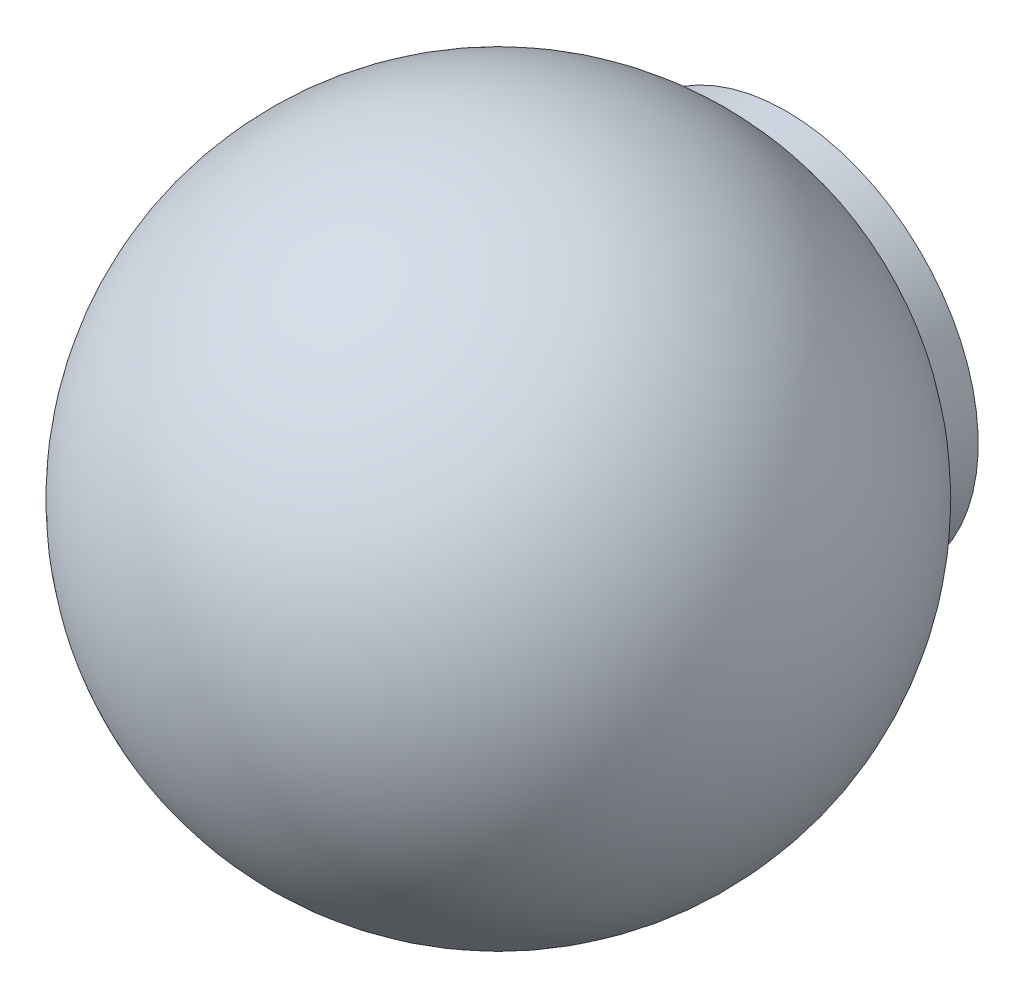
ISO-10303-21;
HEADER;
FILE_DESCRIPTION(('STEP AP214'),'2;1');
FILE_NAME('part.step','',(''),(''),'','','');
FILE_SCHEMA(('AUTOMOTIVE_DESIGN { 1 0 10303 214 1 1 1 1 }'));
ENDSEC;
DATA;
#1=APPLICATION_CONTEXT('core data for automotive mechanical design processes');
#2=APPLICATION_PROTOCOL_DEFINITION('international standard','automotive_design',2000,#1);
#3=PRODUCT_CONTEXT('',#1,'mechanical');
#4=PRODUCT('Part','Part','',(#3));
#5=PRODUCT_RELATED_PRODUCT_CATEGORY('part','',(#4));
#6=PRODUCT_DEFINITION_FORMATION('','',#4);
#7=PRODUCT_DEFINITION_CONTEXT('part definition',#1,'design');
#8=PRODUCT_DEFINITION('design','',#6,#7);
#9=PRODUCT_DEFINITION_SHAPE('','',#8);
#10=(LENGTH_UNIT() NAMED_UNIT(*) SI_UNIT(.MILLI.,.METRE.));
#11=(NAMED_UNIT(*) PLANE_ANGLE_UNIT() SI_UNIT($,.RADIAN.));
#12=(NAMED_UNIT(*) SI_UNIT($,.STERADIAN.) SOLID_ANGLE_UNIT());
#13=UNCERTAINTY_MEASURE_WITH_UNIT(LENGTH_MEASURE(1.E-05),#10,'distance_accuracy_value','');
#14=(GEOMETRIC_REPRESENTATION_CONTEXT(3) GLOBAL_UNCERTAINTY_ASSIGNED_CONTEXT((#13)) GLOBAL_UNIT_ASSIGNED_CONTEXT((#10,
#11,#12)) REPRESENTATION_CONTEXT('',''));
#15=CARTESIAN_POINT('',(0.,0.,0.));
#16=DIRECTION('',(0.,0.,1.));
#17=DIRECTION('',(1.,0.,0.));
#18=AXIS2_PLACEMENT_3D('',#15,#16,#17);
#19=CARTESIAN_POINT('',(0.,0.,0.));
#20=DIRECTION('',(0.,0.,-1.));
#21=DIRECTION('',(0.,1.,0.));
#22=AXIS2_PLACEMENT_3D('',#19,#20,#21);
#23=PLANE('',#22);
#24=CARTESIAN_POINT('',(0.,0.,0.));
#25=DIRECTION('',(0.,0.,-1.));
#26=DIRECTION('',(0.,1.,0.));
#27=AXIS2_PLACEMENT_3D('',#24,#25,#26);
#28=CIRCLE('',#27,2.5);
#29=CARTESIAN_POINT('',(0.,2.5,0.));
#30=VERTEX_POINT('',#29);
#31=EDGE_CURVE('E26',#30,#30,#28,.T.);
#32=ORIENTED_EDGE('',*,*,#31,.F.);
#33=EDGE_LOOP('',(#32));
#34=FACE_BOUND('',#33,.T.);
#35=CARTESIAN_POINT('',(0.,0.,0.));
#36=DIRECTION('',(0.,0.,-1.));
#37=DIRECTION('',(0.,1.,0.));
#38=AXIS2_PLACEMENT_3D('',#35,#36,#37);
#39=CIRCLE('',#38,6.);
#40=CARTESIAN_POINT('',(0.,6.,0.));
#41=VERTEX_POINT('',#40);
#42=EDGE_CURVE('E8',#41,#41,#39,.T.);
#43=ORIENTED_EDGE('',*,*,#42,.T.);
#44=EDGE_LOOP('',(#43));
#45=FACE_BOUND('',#44,.T.);
#46=ADVANCED_FACE('F12',(#34,#45),#23,.T.);
#47=CARTESIAN_POINT('',(0.,0.,0.));
#48=DIRECTION('',(0.,0.,-1.));
#49=DIRECTION('',(0.,1.,0.));
#50=AXIS2_PLACEMENT_3D('',#47,#48,#49);
#51=CYLINDRICAL_SURFACE('',#50,6.);
#52=CARTESIAN_POINT('',(0.,0.,0.999999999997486));
#53=DIRECTION('',(0.,0.,-1.));
#54=DIRECTION('',(0.,1.,0.));
#55=AXIS2_PLACEMENT_3D('',#52,#53,#54);
#56=CIRCLE('',#55,6.);
#57=CARTESIAN_POINT('',(0.,6.,0.999999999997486));
#58=VERTEX_POINT('',#57);
#59=EDGE_CURVE('E18',#58,#58,#56,.T.);
#60=ORIENTED_EDGE('',*,*,#59,.T.);
#61=EDGE_LOOP('',(#60));
#62=FACE_BOUND('',#61,.T.);
#63=ORIENTED_EDGE('',*,*,#42,.F.);
#64=EDGE_LOOP('',(#63));
#65=FACE_BOUND('',#64,.T.);
#66=ADVANCED_FACE('F35',(#62,#65),#51,.T.);
#67=CARTESIAN_POINT('',(1.66533453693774E-12,0.,8.99999999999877));
#68=DIRECTION('',(0.,0.,-1.));
#69=DIRECTION('',(1.,0.,0.));
#70=AXIS2_PLACEMENT_3D('',#67,#68,#69);
#71=SPHERICAL_SURFACE('',#70,10.);
#72=ORIENTED_EDGE('',*,*,#59,.F.);
#73=EDGE_LOOP('',(#72));
#74=FACE_BOUND('',#73,.T.);
#75=ADVANCED_FACE('F41',(#74),#71,.T.);
#76=CARTESIAN_POINT('',(0.,0.,8.));
#77=DIRECTION('',(0.,0.,-1.));
#78=DIRECTION('',(0.,1.,0.));
#79=AXIS2_PLACEMENT_3D('',#76,#77,#78);
#80=CYLINDRICAL_SURFACE('',#79,2.5);
#81=CARTESIAN_POINT('',(0.,0.,8.));
#82=DIRECTION('',(0.,0.,-1.));
#83=DIRECTION('',(0.,1.,0.));
#84=AXIS2_PLACEMENT_3D('',#81,#82,#83);
#85=CIRCLE('',#84,2.5);
#86=CARTESIAN_POINT('',(0.,2.5,8.));
#87=VERTEX_POINT('',#86);
#88=EDGE_CURVE('E22',#87,#87,#85,.T.);
#89=ORIENTED_EDGE('',*,*,#88,.F.);
#90=EDGE_LOOP('',(#89));
#91=FACE_BOUND('',#90,.T.);
#92=ORIENTED_EDGE('',*,*,#31,.T.);
#93=EDGE_LOOP('',(#92));
#94=FACE_BOUND('',#93,.T.);
#95=ADVANCED_FACE('F32',(#91,#94),#80,.F.);
#96=CARTESIAN_POINT('',(0.,0.,8.));
#97=DIRECTION('',(0.,0.,-1.));
#98=DIRECTION('',(0.,1.,0.));
#99=AXIS2_PLACEMENT_3D('',#96,#97,#98);
#100=PLANE('',#99);
#101=ORIENTED_EDGE('',*,*,#88,.T.);
#102=EDGE_LOOP('',(#101));
#103=FACE_BOUND('',#102,.T.);
#104=ADVANCED_FACE('F52',(#103),#100,.T.);
#105=CLOSED_SHELL('',(#46,#66,#75,#95,#104));
#106=MANIFOLD_SOLID_BREP('B1',#105);
#107=ADVANCED_BREP_SHAPE_REPRESENTATION('',(#18,#106),#14);
#108=SHAPE_DEFINITION_REPRESENTATION(#9,#107);
ENDSEC;
END-ISO-10303-21;
